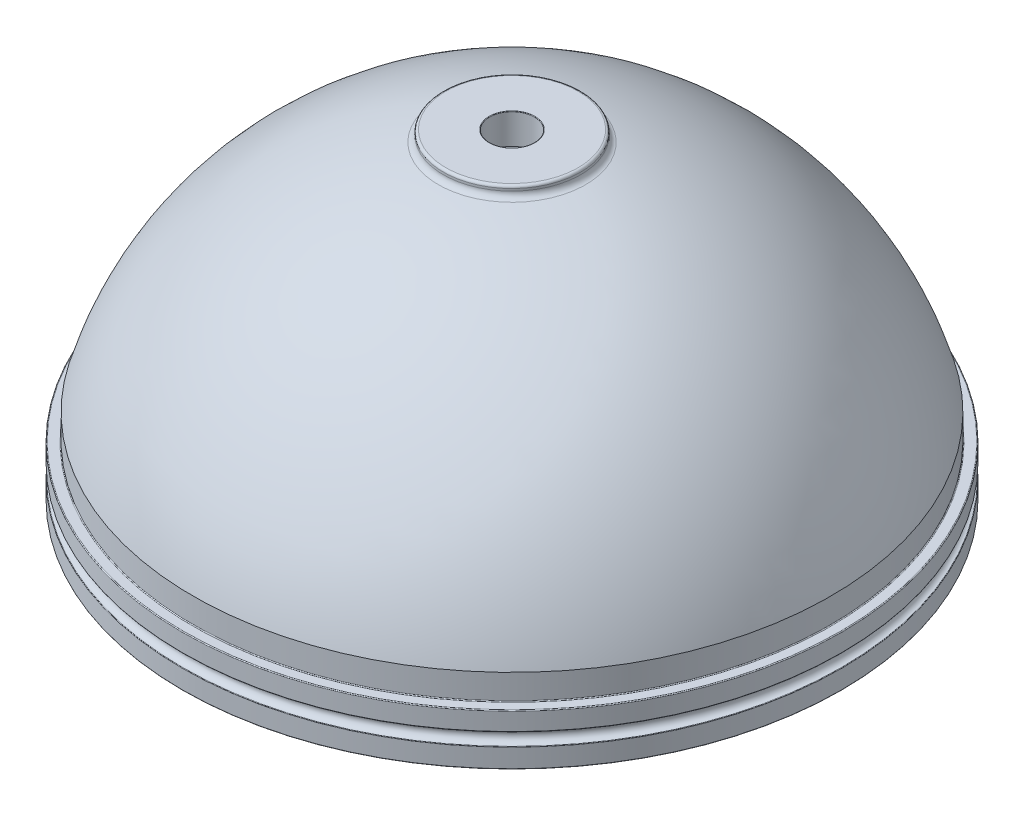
from build123d import *

# Parameters (mm, degrees)
SKETCH2_R          = 3.175
CUT_EXTRUDE3_DEPTH = 3.8608
CIRPATTERN1_COUNT  = 8


with BuildPart() as part:
    # Sketch1 → Base-Revolve (revolve)
    with BuildSketch(Plane.XY, mode=Mode.PRIVATE) as base_revolve_sk:
        with BuildLine():
            Line((-72.0598, 0), (-73.66, 0))
            Line((-73.66, 0), (-73.66, 3.175))
            Line((-73.66, 3.175), (-76.073, 3.175))
            ThreePointArc((-76.073, 3.175), (-76.162802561, 3.212197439), (-76.2, 3.302))
            Line((-76.2, 3.302), (-76.2, 4.9784))
            ThreePointArc((-76.2, 4.9784), (-76.237197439, 5.068202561), (-76.327, 5.1054))
            Line((-76.327, 5.1054), (-79.5909, 5.1054))
            ThreePointArc((-79.5909, 5.1054), (-79.680702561, 5.068202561), (-79.7179, 4.9784))
            Line((-79.7179, 4.9784), (-79.7179, 3.302))
            ThreePointArc((-79.7179, 3.302), (-79.755097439, 3.212197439), (-79.8449, 3.175))
            Line((-79.8449, 3.175), (-82.3722, 3.175))
            ThreePointArc((-82.3722, 3.175), (-82.462002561, 3.212197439), (-82.4992, 3.302))
            Line((-82.4992, 3.302), (-82.4992, 7.942210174))
            ThreePointArc((-82.4992, 7.942210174), (-82.46526917, 8.028622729), (-82.381607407, 8.068861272))
            ThreePointArc((-82.381607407, 8.068861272), (-80.9117, 9.652), (-82.381607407, 11.235138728))
            ThreePointArc((-82.381607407, 11.235138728), (-82.46526917, 11.275377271), (-82.4992, 11.361789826))
            Line((-82.4992, 11.361789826), (-82.4992, 15.748))
            ThreePointArc((-82.4992, 15.748), (-82.439684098, 15.891684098), (-82.296, 15.9512))
            Line((-82.296, 15.9512), (-80.0354, 15.9512))
            ThreePointArc((-80.0354, 15.9512), (-79.891715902, 16.010715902), (-79.8322, 16.1544))
            Line((-79.8322, 16.1544), (-79.8322, 22.3012))
            ThreePointArc((-79.8322, 22.3012), (-57.185697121, 60.001885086), (-18.442573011, 80.814767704))
            ThreePointArc((-18.442573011, 80.814767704), (-17.554786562, 81.372705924), (-17.2085, 82.36242581))
            Line((-17.2085, 82.36242581), (-17.2085, 82.931))
            ThreePointArc((-17.2085, 82.931), (-17.022512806, 83.380012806), (-16.5735, 83.566))
            Line((-16.5735, 83.566), (-5.7404, 83.566))
            ThreePointArc((-5.7404, 83.566), (-5.650597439, 83.528802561), (-5.6134, 83.439))
            Line((-5.6134, 83.439), (-5.6134, 75.946))
            Line((-5.6134, 75.946), (-3.2639, 75.946))
            Line((-3.2639, 75.946), (-3.2639, 74.041))
            Line((-3.2639, 74.041), (-8.73125, 74.041))
            Line((-8.73125, 74.041), (-8.73125, 60.2488))
            Line((-8.73125, 60.2488), (-12.7, 60.2488))
            Line((-12.7, 60.2488), (-12.7, 72.9488))
            ThreePointArc((-12.7, 72.9488), (-13.429291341, 74.956349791), (-15.2654, 76.0476))
            ThreePointArc((-15.2654, 76.0476), (-50.460435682, 58.899681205), (-72.7964, 26.7462))
            ThreePointArc((-72.7964, 26.7462), (-73.49703435, 21.002889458), (-71.5772, 15.5448))
            Line((-71.5772, 15.5448), (-69.8373, 12.8016))
            Line((-69.8373, 12.8016), (-69.8373, 9.6266))
            Line((-69.8373, 9.6266), (-71.6026, 9.6266))
            Line((-71.6026, 9.6266), (-71.6026, 7.874))
            Line((-71.6026, 7.874), (-69.8373, 7.874))
            Line((-69.8373, 7.874), (-69.8373, 3.8608))
            Line((-69.8373, 3.8608), (-72.0598, 0))
        make_face()
    revolve(base_revolve_sk.sketch.rotate(Axis((0, 0, 0), (0, 1, 0)), 270), axis=Axis((0, 0, 0), (0, 1, 0)))

    # Sketch2 → Cut-Extrude3 (cut)
    with BuildSketch(Plane(origin=(0, 0, 0), x_dir=(1, 0, 0), z_dir=(0, 1, 0))):
        with Locations((0, 68.8467)):
            Circle(SKETCH2_R)
    cut_extrude3 = extrude(amount=CUT_EXTRUDE3_DEPTH, mode=Mode.SUBTRACT)

    # CirPattern1: Cut-Extrude3 ×8 about axis
    cirpattern1_axis = Axis((0, 0, 0), (0, 1, 0))
    for i in range(1, CIRPATTERN1_COUNT):
        add(cut_extrude3.rotate(cirpattern1_axis, i * 360 / CIRPATTERN1_COUNT), mode=Mode.SUBTRACT)


solid = part.part
